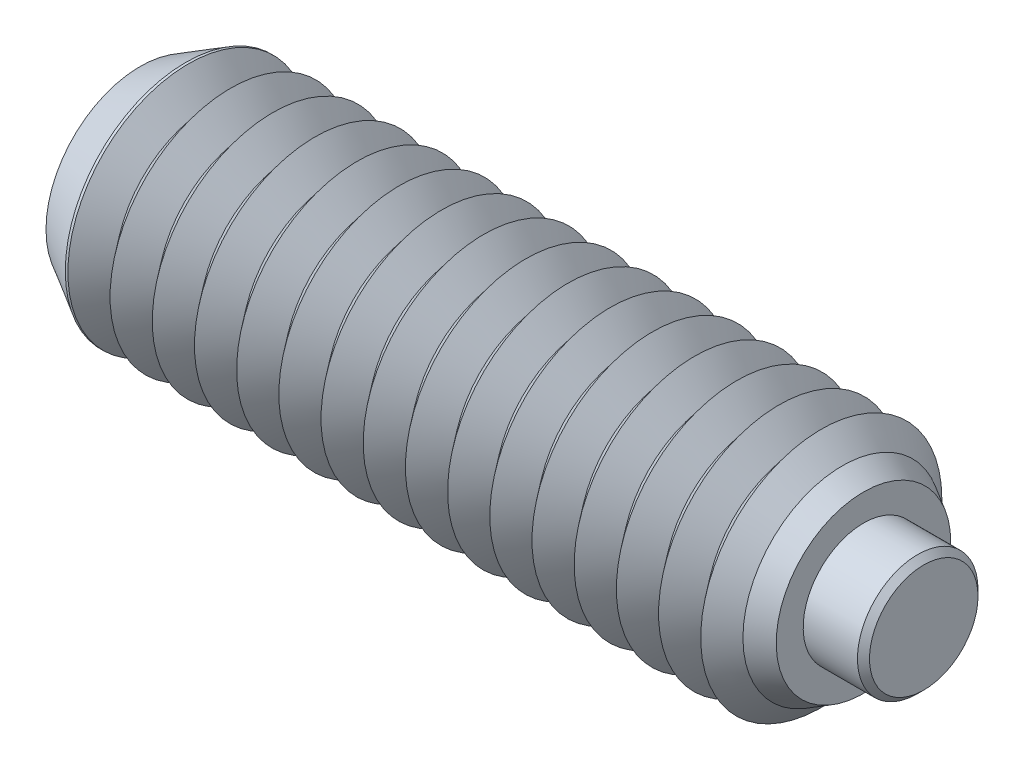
ISO-10303-21;
HEADER;
FILE_DESCRIPTION(('STEP AP214'),'2;1');
FILE_NAME('part.step','',(''),(''),'','','');
FILE_SCHEMA(('AUTOMOTIVE_DESIGN { 1 0 10303 214 1 1 1 1 }'));
ENDSEC;
DATA;
#1=APPLICATION_CONTEXT('core data for automotive mechanical design processes');
#2=APPLICATION_PROTOCOL_DEFINITION('international standard','automotive_design',2000,#1);
#3=PRODUCT_CONTEXT('',#1,'mechanical');
#4=PRODUCT('Part','Part','',(#3));
#5=PRODUCT_RELATED_PRODUCT_CATEGORY('part','',(#4));
#6=PRODUCT_DEFINITION_FORMATION('','',#4);
#7=PRODUCT_DEFINITION_CONTEXT('part definition',#1,'design');
#8=PRODUCT_DEFINITION('design','',#6,#7);
#9=PRODUCT_DEFINITION_SHAPE('','',#8);
#10=(LENGTH_UNIT() NAMED_UNIT(*) SI_UNIT(.MILLI.,.METRE.));
#11=(NAMED_UNIT(*) PLANE_ANGLE_UNIT() SI_UNIT($,.RADIAN.));
#12=(NAMED_UNIT(*) SI_UNIT($,.STERADIAN.) SOLID_ANGLE_UNIT());
#13=UNCERTAINTY_MEASURE_WITH_UNIT(LENGTH_MEASURE(1.E-05),#10,'distance_accuracy_value','');
#14=(GEOMETRIC_REPRESENTATION_CONTEXT(3) GLOBAL_UNCERTAINTY_ASSIGNED_CONTEXT((#13)) GLOBAL_UNIT_ASSIGNED_CONTEXT((#10,
#11,#12)) REPRESENTATION_CONTEXT('',''));
#15=CARTESIAN_POINT('',(0.,0.,0.));
#16=DIRECTION('',(0.,0.,1.));
#17=DIRECTION('',(1.,0.,0.));
#18=AXIS2_PLACEMENT_3D('',#15,#16,#17);
#19=CARTESIAN_POINT('',(1.35,0.,0.));
#20=DIRECTION('',(-1.,0.,0.));
#21=DIRECTION('',(0.,0.,1.));
#22=AXIS2_PLACEMENT_3D('',#19,#20,#21);
#23=CYLINDRICAL_SURFACE('',#22,1.);
#24=CARTESIAN_POINT('',(1.25,0.,0.));
#25=DIRECTION('',(1.,0.,0.));
#26=DIRECTION('',(0.,0.,-1.));
#27=AXIS2_PLACEMENT_3D('',#24,#25,#26);
#28=CIRCLE('',#27,1.);
#29=CARTESIAN_POINT('',(1.25,0.,-1.));
#30=VERTEX_POINT('',#29);
#31=EDGE_CURVE('P0_E10',#30,#30,#28,.F.);
#32=ORIENTED_EDGE('',*,*,#31,.T.);
#33=EDGE_LOOP('',(#32));
#34=FACE_BOUND('',#33,.T.);
#35=CARTESIAN_POINT('',(-0.65,0.,0.));
#36=DIRECTION('',(1.,0.,0.));
#37=DIRECTION('',(0.,0.,-1.));
#38=AXIS2_PLACEMENT_3D('',#35,#36,#37);
#39=CIRCLE('',#38,1.);
#40=CARTESIAN_POINT('',(-0.65,0.,-1.));
#41=VERTEX_POINT('',#40);
#42=EDGE_CURVE('P0_E25',#41,#41,#39,.T.);
#43=ORIENTED_EDGE('',*,*,#42,.T.);
#44=EDGE_LOOP('',(#43));
#45=FACE_BOUND('',#44,.T.);
#46=ADVANCED_FACE('P0_F14',(#34,#45),#23,.T.);
#47=CARTESIAN_POINT('',(1.35,0.,0.));
#48=DIRECTION('',(1.,0.,0.));
#49=DIRECTION('',(0.,0.,-1.));
#50=AXIS2_PLACEMENT_3D('',#47,#48,#49);
#51=PLANE('',#50);
#52=CARTESIAN_POINT('',(1.35,0.,0.));
#53=DIRECTION('',(1.,0.,0.));
#54=DIRECTION('',(0.,0.,-1.));
#55=AXIS2_PLACEMENT_3D('',#52,#53,#54);
#56=CIRCLE('',#55,0.899999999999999);
#57=CARTESIAN_POINT('',(1.35,0.,-0.899999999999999));
#58=VERTEX_POINT('',#57);
#59=EDGE_CURVE('P0_E21',#58,#58,#56,.T.);
#60=ORIENTED_EDGE('',*,*,#59,.T.);
#61=EDGE_LOOP('',(#60));
#62=FACE_BOUND('',#61,.T.);
#63=ADVANCED_FACE('P0_F35',(#62),#51,.T.);
#64=CARTESIAN_POINT('',(-0.65,0.,0.));
#65=DIRECTION('',(1.,0.,0.));
#66=DIRECTION('',(0.,0.,-1.));
#67=AXIS2_PLACEMENT_3D('',#64,#65,#66);
#68=PLANE('',#67);
#69=ORIENTED_EDGE('',*,*,#42,.F.);
#70=EDGE_LOOP('',(#69));
#71=FACE_BOUND('',#70,.T.);
#72=ADVANCED_FACE('P0_F33',(#71),#68,.F.);
#73=CARTESIAN_POINT('',(1.35,0.,0.));
#74=DIRECTION('',(-1.,0.,0.));
#75=DIRECTION('',(0.,0.,1.));
#76=AXIS2_PLACEMENT_3D('',#73,#74,#75);
#77=CONICAL_SURFACE('',#76,0.899999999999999,0.785398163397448);
#78=ORIENTED_EDGE('',*,*,#31,.F.);
#79=EDGE_LOOP('',(#78));
#80=FACE_BOUND('',#79,.T.);
#81=ORIENTED_EDGE('',*,*,#59,.F.);
#82=EDGE_LOOP('',(#81));
#83=FACE_BOUND('',#82,.T.);
#84=ADVANCED_FACE('P0_F16',(#80,#83),#77,.T.);
#85=CLOSED_SHELL('',(#46,#63,#72,#84));
#86=MANIFOLD_SOLID_BREP('P0_B1',#85);
#87=CARTESIAN_POINT('',(-11.65,0.,0.));
#88=DIRECTION('',(1.,0.,0.));
#89=DIRECTION('',(0.,0.,-1.));
#90=AXIS2_PLACEMENT_3D('',#87,#88,#89);
#91=CYLINDRICAL_SURFACE('',#90,2.);
#92=CARTESIAN_POINT('',(-10.85,0.,0.));
#93=DIRECTION('',(1.,0.,0.));
#94=DIRECTION('',(0.,0.,-1.));
#95=AXIS2_PLACEMENT_3D('',#92,#93,#94);
#96=CIRCLE('',#95,2.);
#97=CARTESIAN_POINT('',(-10.85,0.,-2.));
#98=VERTEX_POINT('',#97);
#99=EDGE_CURVE('P1_E226',#98,#98,#96,.T.);
#100=ORIENTED_EDGE('',*,*,#99,.F.);
#101=EDGE_LOOP('',(#100));
#102=FACE_BOUND('',#101,.T.);
#103=CARTESIAN_POINT('',(-10.8928342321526,0.,0.));
#104=DIRECTION('',(1.,0.,0.));
#105=DIRECTION('',(0.,0.,-1.));
#106=AXIS2_PLACEMENT_3D('',#103,#104,#105);
#107=CIRCLE('',#106,2.);
#108=CARTESIAN_POINT('',(-10.8928342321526,0.,-2.));
#109=VERTEX_POINT('',#108);
#110=EDGE_CURVE('P1_E229',#109,#109,#107,.T.);
#111=ORIENTED_EDGE('',*,*,#110,.T.);
#112=EDGE_LOOP('',(#111));
#113=FACE_BOUND('',#112,.T.);
#114=ADVANCED_FACE('P1_F15',(#102,#113),#91,.T.);
#115=CARTESIAN_POINT('',(-0.700000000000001,0.,0.));
#116=DIRECTION('',(1.,0.,0.));
#117=DIRECTION('',(0.,0.,-1.));
#118=AXIS2_PLACEMENT_3D('',#115,#116,#117);
#119=CONICAL_SURFACE('',#118,1.56285014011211,0.895664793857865);
#120=CARTESIAN_POINT('',(-0.350000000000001,0.,0.));
#121=DIRECTION('',(1.,0.,0.));
#122=DIRECTION('',(0.,0.,-1.));
#123=AXIS2_PLACEMENT_3D('',#120,#121,#122);
#124=CIRCLE('',#123,2.);
#125=CARTESIAN_POINT('',(-0.350000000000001,0.,-2.));
#126=VERTEX_POINT('',#125);
#127=EDGE_CURVE('P1_E284',#126,#126,#124,.T.);
#128=ORIENTED_EDGE('',*,*,#127,.F.);
#129=EDGE_LOOP('',(#128));
#130=FACE_BOUND('',#129,.T.);
#131=CARTESIAN_POINT('',(-0.700000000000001,0.,0.));
#132=DIRECTION('',(1.,0.,0.));
#133=DIRECTION('',(0.,0.,-1.));
#134=AXIS2_PLACEMENT_3D('',#131,#132,#133);
#135=CIRCLE('',#134,1.56285014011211);
#136=CARTESIAN_POINT('',(-0.700000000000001,0.,-1.56285014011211));
#137=VERTEX_POINT('',#136);
#138=EDGE_CURVE('P1_E289',#137,#137,#135,.T.);
#139=ORIENTED_EDGE('',*,*,#138,.T.);
#140=EDGE_LOOP('',(#139));
#141=FACE_BOUND('',#140,.T.);
#142=ADVANCED_FACE('P1_F214',(#130,#141),#119,.T.);
#143=CARTESIAN_POINT('',(-1.05,0.,0.));
#144=DIRECTION('',(-1.,0.,0.));
#145=DIRECTION('',(0.,0.,1.));
#146=AXIS2_PLACEMENT_3D('',#143,#144,#145);
#147=CONICAL_SURFACE('',#146,2.,0.895664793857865);
#148=ORIENTED_EDGE('',*,*,#138,.F.);
#149=EDGE_LOOP('',(#148));
#150=FACE_BOUND('',#149,.T.);
#151=CARTESIAN_POINT('',(-1.05,0.,0.));
#152=DIRECTION('',(1.,0.,0.));
#153=DIRECTION('',(0.,0.,-1.));
#154=AXIS2_PLACEMENT_3D('',#151,#152,#153);
#155=CIRCLE('',#154,2.);
#156=CARTESIAN_POINT('',(-1.05,0.,-2.));
#157=VERTEX_POINT('',#156);
#158=EDGE_CURVE('P1_E292',#157,#157,#155,.T.);
#159=ORIENTED_EDGE('',*,*,#158,.T.);
#160=EDGE_LOOP('',(#159));
#161=FACE_BOUND('',#160,.T.);
#162=ADVANCED_FACE('P1_F220',(#150,#161),#147,.T.);
#163=CARTESIAN_POINT('',(-0.65,0.,0.));
#164=DIRECTION('',(1.,0.,0.));
#165=DIRECTION('',(0.,1.,0.));
#166=AXIS2_PLACEMENT_3D('',#163,#164,#165);
#167=PLANE('',#166);
#168=CARTESIAN_POINT('',(-0.65,0.,0.));
#169=DIRECTION('',(1.,0.,0.));
#170=DIRECTION('',(0.,1.,0.));
#171=AXIS2_PLACEMENT_3D('',#168,#169,#170);
#172=CIRCLE('',#171,1.);
#173=CARTESIAN_POINT('',(-0.65,1.,0.));
#174=VERTEX_POINT('',#173);
#175=EDGE_CURVE('P1_E279',#174,#174,#172,.T.);
#176=ORIENTED_EDGE('',*,*,#175,.T.);
#177=EDGE_LOOP('',(#176));
#178=FACE_BOUND('',#177,.T.);
#179=ADVANCED_FACE('P1_F493',(#178),#167,.T.);
#180=CARTESIAN_POINT('',(-0.65,0.,0.));
#181=DIRECTION('',(1.,0.,0.));
#182=DIRECTION('',(0.,1.,0.));
#183=AXIS2_PLACEMENT_3D('',#180,#181,#182);
#184=CYLINDRICAL_SURFACE('',#183,1.);
#185=ORIENTED_EDGE('',*,*,#175,.F.);
#186=EDGE_LOOP('',(#185));
#187=FACE_BOUND('',#186,.T.);
#188=CARTESIAN_POINT('',(0.35,0.,0.));
#189=DIRECTION('',(1.,0.,0.));
#190=DIRECTION('',(0.,1.,0.));
#191=AXIS2_PLACEMENT_3D('',#188,#189,#190);
#192=CIRCLE('',#191,1.);
#193=CARTESIAN_POINT('',(0.35,1.,0.));
#194=VERTEX_POINT('',#193);
#195=EDGE_CURVE('P1_E281',#194,#194,#192,.T.);
#196=ORIENTED_EDGE('',*,*,#195,.T.);
#197=EDGE_LOOP('',(#196));
#198=FACE_BOUND('',#197,.T.);
#199=ADVANCED_FACE('P1_F210',(#187,#198),#184,.F.);
#200=CARTESIAN_POINT('',(0.35,1.44792740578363,0.));
#201=DIRECTION('',(1.,0.,0.));
#202=DIRECTION('',(0.,1.,0.));
#203=AXIS2_PLACEMENT_3D('',#200,#201,#202);
#204=PLANE('',#203);
#205=ORIENTED_EDGE('',*,*,#195,.F.);
#206=EDGE_LOOP('',(#205));
#207=FACE_BOUND('',#206,.T.);
#208=CARTESIAN_POINT('',(0.35,0.,0.));
#209=DIRECTION('',(1.,0.,0.));
#210=DIRECTION('',(0.,1.,0.));
#211=AXIS2_PLACEMENT_3D('',#208,#209,#210);
#212=CIRCLE('',#211,1.44792740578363);
#213=CARTESIAN_POINT('',(0.35,1.44792740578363,0.));
#214=VERTEX_POINT('',#213);
#215=EDGE_CURVE('P1_E121',#214,#214,#212,.T.);
#216=ORIENTED_EDGE('',*,*,#215,.T.);
#217=EDGE_LOOP('',(#216));
#218=FACE_BOUND('',#217,.T.);
#219=ADVANCED_FACE('P1_F206',(#207,#218),#204,.T.);
#220=CARTESIAN_POINT('',(0.35,0.,0.));
#221=DIRECTION('',(-1.,0.,0.));
#222=DIRECTION('',(0.,-1.,0.));
#223=AXIS2_PLACEMENT_3D('',#220,#221,#222);
#224=CONICAL_SURFACE('',#223,1.44792740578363,0.523598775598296);
#225=CARTESIAN_POINT('',(0.,0.,0.));
#226=DIRECTION('',(1.,0.,0.));
#227=DIRECTION('',(0.,0.,-1.));
#228=AXIS2_PLACEMENT_3D('',#225,#226,#227);
#229=CIRCLE('',#228,1.65);
#230=CARTESIAN_POINT('',(0.,0.,-1.65));
#231=VERTEX_POINT('',#230);
#232=EDGE_CURVE('P1_E236',#231,#231,#229,.T.);
#233=ORIENTED_EDGE('',*,*,#232,.T.);
#234=EDGE_LOOP('',(#233));
#235=FACE_BOUND('',#234,.T.);
#236=ORIENTED_EDGE('',*,*,#215,.F.);
#237=EDGE_LOOP('',(#236));
#238=FACE_BOUND('',#237,.T.);
#239=ADVANCED_FACE('P1_F203',(#235,#238),#224,.T.);
#240=CARTESIAN_POINT('',(0.,0.,0.));
#241=DIRECTION('',(-1.,0.,0.));
#242=DIRECTION('',(0.,0.,1.));
#243=AXIS2_PLACEMENT_3D('',#240,#241,#242);
#244=CONICAL_SURFACE('',#243,1.65,0.785398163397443);
#245=ORIENTED_EDGE('',*,*,#127,.T.);
#246=EDGE_LOOP('',(#245));
#247=FACE_BOUND('',#246,.T.);
#248=ORIENTED_EDGE('',*,*,#232,.F.);
#249=EDGE_LOOP('',(#248));
#250=FACE_BOUND('',#249,.T.);
#251=ADVANCED_FACE('P1_F17',(#247,#250),#244,.T.);
#252=CARTESIAN_POINT('',(-1.4,0.,0.));
#253=DIRECTION('',(1.,0.,0.));
#254=DIRECTION('',(0.,0.,-1.));
#255=AXIS2_PLACEMENT_3D('',#252,#253,#254);
#256=CONICAL_SURFACE('',#255,1.56285014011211,0.895664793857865);
#257=ORIENTED_EDGE('',*,*,#158,.F.);
#258=EDGE_LOOP('',(#257));
#259=FACE_BOUND('',#258,.T.);
#260=CARTESIAN_POINT('',(-1.4,0.,0.));
#261=DIRECTION('',(1.,0.,0.));
#262=DIRECTION('',(0.,0.,-1.));
#263=AXIS2_PLACEMENT_3D('',#260,#261,#262);
#264=CIRCLE('',#263,1.56285014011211);
#265=CARTESIAN_POINT('',(-1.4,0.,-1.56285014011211));
#266=VERTEX_POINT('',#265);
#267=EDGE_CURVE('P1_E295',#266,#266,#264,.T.);
#268=ORIENTED_EDGE('',*,*,#267,.T.);
#269=EDGE_LOOP('',(#268));
#270=FACE_BOUND('',#269,.T.);
#271=ADVANCED_FACE('P1_F487',(#259,#270),#256,.T.);
#272=CARTESIAN_POINT('',(-1.75,0.,0.));
#273=DIRECTION('',(-1.,0.,0.));
#274=DIRECTION('',(0.,0.,1.));
#275=AXIS2_PLACEMENT_3D('',#272,#273,#274);
#276=CONICAL_SURFACE('',#275,2.,0.895664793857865);
#277=ORIENTED_EDGE('',*,*,#267,.F.);
#278=EDGE_LOOP('',(#277));
#279=FACE_BOUND('',#278,.T.);
#280=CARTESIAN_POINT('',(-1.75,0.,0.));
#281=DIRECTION('',(1.,0.,0.));
#282=DIRECTION('',(0.,0.,-1.));
#283=AXIS2_PLACEMENT_3D('',#280,#281,#282);
#284=CIRCLE('',#283,2.);
#285=CARTESIAN_POINT('',(-1.75,0.,-2.));
#286=VERTEX_POINT('',#285);
#287=EDGE_CURVE('P1_E298',#286,#286,#284,.T.);
#288=ORIENTED_EDGE('',*,*,#287,.T.);
#289=EDGE_LOOP('',(#288));
#290=FACE_BOUND('',#289,.T.);
#291=ADVANCED_FACE('P1_F483',(#279,#290),#276,.T.);
#292=CARTESIAN_POINT('',(-2.1,0.,0.));
#293=DIRECTION('',(1.,0.,0.));
#294=DIRECTION('',(0.,0.,-1.));
#295=AXIS2_PLACEMENT_3D('',#292,#293,#294);
#296=CONICAL_SURFACE('',#295,1.56285014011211,0.895664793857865);
#297=ORIENTED_EDGE('',*,*,#287,.F.);
#298=EDGE_LOOP('',(#297));
#299=FACE_BOUND('',#298,.T.);
#300=CARTESIAN_POINT('',(-2.1,0.,0.));
#301=DIRECTION('',(1.,0.,0.));
#302=DIRECTION('',(0.,0.,-1.));
#303=AXIS2_PLACEMENT_3D('',#300,#301,#302);
#304=CIRCLE('',#303,1.56285014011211);
#305=CARTESIAN_POINT('',(-2.1,0.,-1.56285014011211));
#306=VERTEX_POINT('',#305);
#307=EDGE_CURVE('P1_E301',#306,#306,#304,.T.);
#308=ORIENTED_EDGE('',*,*,#307,.T.);
#309=EDGE_LOOP('',(#308));
#310=FACE_BOUND('',#309,.T.);
#311=ADVANCED_FACE('P1_F479',(#299,#310),#296,.T.);
#312=CARTESIAN_POINT('',(-2.45,0.,0.));
#313=DIRECTION('',(-1.,0.,0.));
#314=DIRECTION('',(0.,0.,1.));
#315=AXIS2_PLACEMENT_3D('',#312,#313,#314);
#316=CONICAL_SURFACE('',#315,2.,0.895664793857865);
#317=ORIENTED_EDGE('',*,*,#307,.F.);
#318=EDGE_LOOP('',(#317));
#319=FACE_BOUND('',#318,.T.);
#320=CARTESIAN_POINT('',(-2.45,0.,0.));
#321=DIRECTION('',(1.,0.,0.));
#322=DIRECTION('',(0.,0.,-1.));
#323=AXIS2_PLACEMENT_3D('',#320,#321,#322);
#324=CIRCLE('',#323,2.);
#325=CARTESIAN_POINT('',(-2.45,0.,-2.));
#326=VERTEX_POINT('',#325);
#327=EDGE_CURVE('P1_E304',#326,#326,#324,.T.);
#328=ORIENTED_EDGE('',*,*,#327,.T.);
#329=EDGE_LOOP('',(#328));
#330=FACE_BOUND('',#329,.T.);
#331=ADVANCED_FACE('P1_F475',(#319,#330),#316,.T.);
#332=CARTESIAN_POINT('',(-2.8,0.,0.));
#333=DIRECTION('',(1.,0.,0.));
#334=DIRECTION('',(0.,0.,-1.));
#335=AXIS2_PLACEMENT_3D('',#332,#333,#334);
#336=CONICAL_SURFACE('',#335,1.56285014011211,0.895664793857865);
#337=ORIENTED_EDGE('',*,*,#327,.F.);
#338=EDGE_LOOP('',(#337));
#339=FACE_BOUND('',#338,.T.);
#340=CARTESIAN_POINT('',(-2.8,0.,0.));
#341=DIRECTION('',(1.,0.,0.));
#342=DIRECTION('',(0.,0.,-1.));
#343=AXIS2_PLACEMENT_3D('',#340,#341,#342);
#344=CIRCLE('',#343,1.56285014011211);
#345=CARTESIAN_POINT('',(-2.8,0.,-1.56285014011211));
#346=VERTEX_POINT('',#345);
#347=EDGE_CURVE('P1_E307',#346,#346,#344,.T.);
#348=ORIENTED_EDGE('',*,*,#347,.T.);
#349=EDGE_LOOP('',(#348));
#350=FACE_BOUND('',#349,.T.);
#351=ADVANCED_FACE('P1_F471',(#339,#350),#336,.T.);
#352=CARTESIAN_POINT('',(-3.15,0.,0.));
#353=DIRECTION('',(-1.,0.,0.));
#354=DIRECTION('',(0.,0.,1.));
#355=AXIS2_PLACEMENT_3D('',#352,#353,#354);
#356=CONICAL_SURFACE('',#355,2.,0.895664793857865);
#357=ORIENTED_EDGE('',*,*,#347,.F.);
#358=EDGE_LOOP('',(#357));
#359=FACE_BOUND('',#358,.T.);
#360=CARTESIAN_POINT('',(-3.15,0.,0.));
#361=DIRECTION('',(1.,0.,0.));
#362=DIRECTION('',(0.,0.,-1.));
#363=AXIS2_PLACEMENT_3D('',#360,#361,#362);
#364=CIRCLE('',#363,2.);
#365=CARTESIAN_POINT('',(-3.15,0.,-2.));
#366=VERTEX_POINT('',#365);
#367=EDGE_CURVE('P1_E310',#366,#366,#364,.T.);
#368=ORIENTED_EDGE('',*,*,#367,.T.);
#369=EDGE_LOOP('',(#368));
#370=FACE_BOUND('',#369,.T.);
#371=ADVANCED_FACE('P1_F467',(#359,#370),#356,.T.);
#372=CARTESIAN_POINT('',(-3.5,0.,0.));
#373=DIRECTION('',(1.,0.,0.));
#374=DIRECTION('',(0.,0.,-1.));
#375=AXIS2_PLACEMENT_3D('',#372,#373,#374);
#376=CONICAL_SURFACE('',#375,1.56285014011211,0.895664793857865);
#377=ORIENTED_EDGE('',*,*,#367,.F.);
#378=EDGE_LOOP('',(#377));
#379=FACE_BOUND('',#378,.T.);
#380=CARTESIAN_POINT('',(-3.5,0.,0.));
#381=DIRECTION('',(1.,0.,0.));
#382=DIRECTION('',(0.,0.,-1.));
#383=AXIS2_PLACEMENT_3D('',#380,#381,#382);
#384=CIRCLE('',#383,1.56285014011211);
#385=CARTESIAN_POINT('',(-3.5,0.,-1.56285014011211));
#386=VERTEX_POINT('',#385);
#387=EDGE_CURVE('P1_E313',#386,#386,#384,.T.);
#388=ORIENTED_EDGE('',*,*,#387,.T.);
#389=EDGE_LOOP('',(#388));
#390=FACE_BOUND('',#389,.T.);
#391=ADVANCED_FACE('P1_F463',(#379,#390),#376,.T.);
#392=CARTESIAN_POINT('',(-3.85,0.,0.));
#393=DIRECTION('',(-1.,0.,0.));
#394=DIRECTION('',(0.,0.,1.));
#395=AXIS2_PLACEMENT_3D('',#392,#393,#394);
#396=CONICAL_SURFACE('',#395,2.,0.895664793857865);
#397=ORIENTED_EDGE('',*,*,#387,.F.);
#398=EDGE_LOOP('',(#397));
#399=FACE_BOUND('',#398,.T.);
#400=CARTESIAN_POINT('',(-3.85,0.,0.));
#401=DIRECTION('',(1.,0.,0.));
#402=DIRECTION('',(0.,0.,-1.));
#403=AXIS2_PLACEMENT_3D('',#400,#401,#402);
#404=CIRCLE('',#403,2.);
#405=CARTESIAN_POINT('',(-3.85,0.,-2.));
#406=VERTEX_POINT('',#405);
#407=EDGE_CURVE('P1_E316',#406,#406,#404,.T.);
#408=ORIENTED_EDGE('',*,*,#407,.T.);
#409=EDGE_LOOP('',(#408));
#410=FACE_BOUND('',#409,.T.);
#411=ADVANCED_FACE('P1_F459',(#399,#410),#396,.T.);
#412=CARTESIAN_POINT('',(-4.2,0.,0.));
#413=DIRECTION('',(1.,0.,0.));
#414=DIRECTION('',(0.,0.,-1.));
#415=AXIS2_PLACEMENT_3D('',#412,#413,#414);
#416=CONICAL_SURFACE('',#415,1.56285014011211,0.895664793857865);
#417=ORIENTED_EDGE('',*,*,#407,.F.);
#418=EDGE_LOOP('',(#417));
#419=FACE_BOUND('',#418,.T.);
#420=CARTESIAN_POINT('',(-4.2,0.,0.));
#421=DIRECTION('',(1.,0.,0.));
#422=DIRECTION('',(0.,0.,-1.));
#423=AXIS2_PLACEMENT_3D('',#420,#421,#422);
#424=CIRCLE('',#423,1.56285014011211);
#425=CARTESIAN_POINT('',(-4.2,0.,-1.56285014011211));
#426=VERTEX_POINT('',#425);
#427=EDGE_CURVE('P1_E319',#426,#426,#424,.T.);
#428=ORIENTED_EDGE('',*,*,#427,.T.);
#429=EDGE_LOOP('',(#428));
#430=FACE_BOUND('',#429,.T.);
#431=ADVANCED_FACE('P1_F455',(#419,#430),#416,.T.);
#432=CARTESIAN_POINT('',(-4.55,0.,0.));
#433=DIRECTION('',(-1.,0.,0.));
#434=DIRECTION('',(0.,0.,1.));
#435=AXIS2_PLACEMENT_3D('',#432,#433,#434);
#436=CONICAL_SURFACE('',#435,2.,0.895664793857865);
#437=ORIENTED_EDGE('',*,*,#427,.F.);
#438=EDGE_LOOP('',(#437));
#439=FACE_BOUND('',#438,.T.);
#440=CARTESIAN_POINT('',(-4.55,0.,0.));
#441=DIRECTION('',(1.,0.,0.));
#442=DIRECTION('',(0.,0.,-1.));
#443=AXIS2_PLACEMENT_3D('',#440,#441,#442);
#444=CIRCLE('',#443,2.);
#445=CARTESIAN_POINT('',(-4.55,0.,-2.));
#446=VERTEX_POINT('',#445);
#447=EDGE_CURVE('P1_E322',#446,#446,#444,.T.);
#448=ORIENTED_EDGE('',*,*,#447,.T.);
#449=EDGE_LOOP('',(#448));
#450=FACE_BOUND('',#449,.T.);
#451=ADVANCED_FACE('P1_F451',(#439,#450),#436,.T.);
#452=CARTESIAN_POINT('',(-4.9,0.,0.));
#453=DIRECTION('',(1.,0.,0.));
#454=DIRECTION('',(0.,0.,-1.));
#455=AXIS2_PLACEMENT_3D('',#452,#453,#454);
#456=CONICAL_SURFACE('',#455,1.56285014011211,0.895664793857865);
#457=ORIENTED_EDGE('',*,*,#447,.F.);
#458=EDGE_LOOP('',(#457));
#459=FACE_BOUND('',#458,.T.);
#460=CARTESIAN_POINT('',(-4.9,0.,0.));
#461=DIRECTION('',(1.,0.,0.));
#462=DIRECTION('',(0.,0.,-1.));
#463=AXIS2_PLACEMENT_3D('',#460,#461,#462);
#464=CIRCLE('',#463,1.56285014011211);
#465=CARTESIAN_POINT('',(-4.9,0.,-1.56285014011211));
#466=VERTEX_POINT('',#465);
#467=EDGE_CURVE('P1_E325',#466,#466,#464,.T.);
#468=ORIENTED_EDGE('',*,*,#467,.T.);
#469=EDGE_LOOP('',(#468));
#470=FACE_BOUND('',#469,.T.);
#471=ADVANCED_FACE('P1_F447',(#459,#470),#456,.T.);
#472=CARTESIAN_POINT('',(-5.25,0.,0.));
#473=DIRECTION('',(-1.,0.,0.));
#474=DIRECTION('',(0.,0.,1.));
#475=AXIS2_PLACEMENT_3D('',#472,#473,#474);
#476=CONICAL_SURFACE('',#475,2.,0.895664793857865);
#477=ORIENTED_EDGE('',*,*,#467,.F.);
#478=EDGE_LOOP('',(#477));
#479=FACE_BOUND('',#478,.T.);
#480=CARTESIAN_POINT('',(-5.25,0.,0.));
#481=DIRECTION('',(1.,0.,0.));
#482=DIRECTION('',(0.,0.,-1.));
#483=AXIS2_PLACEMENT_3D('',#480,#481,#482);
#484=CIRCLE('',#483,2.);
#485=CARTESIAN_POINT('',(-5.25,0.,-2.));
#486=VERTEX_POINT('',#485);
#487=EDGE_CURVE('P1_E328',#486,#486,#484,.T.);
#488=ORIENTED_EDGE('',*,*,#487,.T.);
#489=EDGE_LOOP('',(#488));
#490=FACE_BOUND('',#489,.T.);
#491=ADVANCED_FACE('P1_F443',(#479,#490),#476,.T.);
#492=CARTESIAN_POINT('',(-5.6,0.,0.));
#493=DIRECTION('',(1.,0.,0.));
#494=DIRECTION('',(0.,0.,-1.));
#495=AXIS2_PLACEMENT_3D('',#492,#493,#494);
#496=CONICAL_SURFACE('',#495,1.56285014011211,0.895664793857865);
#497=ORIENTED_EDGE('',*,*,#487,.F.);
#498=EDGE_LOOP('',(#497));
#499=FACE_BOUND('',#498,.T.);
#500=CARTESIAN_POINT('',(-5.6,0.,0.));
#501=DIRECTION('',(1.,0.,0.));
#502=DIRECTION('',(0.,0.,-1.));
#503=AXIS2_PLACEMENT_3D('',#500,#501,#502);
#504=CIRCLE('',#503,1.56285014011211);
#505=CARTESIAN_POINT('',(-5.6,0.,-1.56285014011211));
#506=VERTEX_POINT('',#505);
#507=EDGE_CURVE('P1_E331',#506,#506,#504,.T.);
#508=ORIENTED_EDGE('',*,*,#507,.T.);
#509=EDGE_LOOP('',(#508));
#510=FACE_BOUND('',#509,.T.);
#511=ADVANCED_FACE('P1_F439',(#499,#510),#496,.T.);
#512=CARTESIAN_POINT('',(-5.95,0.,0.));
#513=DIRECTION('',(-1.,0.,0.));
#514=DIRECTION('',(0.,0.,1.));
#515=AXIS2_PLACEMENT_3D('',#512,#513,#514);
#516=CONICAL_SURFACE('',#515,2.,0.895664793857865);
#517=ORIENTED_EDGE('',*,*,#507,.F.);
#518=EDGE_LOOP('',(#517));
#519=FACE_BOUND('',#518,.T.);
#520=CARTESIAN_POINT('',(-5.95,0.,0.));
#521=DIRECTION('',(1.,0.,0.));
#522=DIRECTION('',(0.,0.,-1.));
#523=AXIS2_PLACEMENT_3D('',#520,#521,#522);
#524=CIRCLE('',#523,2.);
#525=CARTESIAN_POINT('',(-5.95,0.,-2.));
#526=VERTEX_POINT('',#525);
#527=EDGE_CURVE('P1_E334',#526,#526,#524,.T.);
#528=ORIENTED_EDGE('',*,*,#527,.T.);
#529=EDGE_LOOP('',(#528));
#530=FACE_BOUND('',#529,.T.);
#531=ADVANCED_FACE('P1_F435',(#519,#530),#516,.T.);
#532=CARTESIAN_POINT('',(-6.3,0.,0.));
#533=DIRECTION('',(1.,0.,0.));
#534=DIRECTION('',(0.,0.,-1.));
#535=AXIS2_PLACEMENT_3D('',#532,#533,#534);
#536=CONICAL_SURFACE('',#535,1.56285014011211,0.895664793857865);
#537=ORIENTED_EDGE('',*,*,#527,.F.);
#538=EDGE_LOOP('',(#537));
#539=FACE_BOUND('',#538,.T.);
#540=CARTESIAN_POINT('',(-6.3,0.,0.));
#541=DIRECTION('',(1.,0.,0.));
#542=DIRECTION('',(0.,0.,-1.));
#543=AXIS2_PLACEMENT_3D('',#540,#541,#542);
#544=CIRCLE('',#543,1.56285014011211);
#545=CARTESIAN_POINT('',(-6.3,0.,-1.56285014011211));
#546=VERTEX_POINT('',#545);
#547=EDGE_CURVE('P1_E337',#546,#546,#544,.T.);
#548=ORIENTED_EDGE('',*,*,#547,.T.);
#549=EDGE_LOOP('',(#548));
#550=FACE_BOUND('',#549,.T.);
#551=ADVANCED_FACE('P1_F431',(#539,#550),#536,.T.);
#552=CARTESIAN_POINT('',(-6.65,0.,0.));
#553=DIRECTION('',(-1.,0.,0.));
#554=DIRECTION('',(0.,0.,1.));
#555=AXIS2_PLACEMENT_3D('',#552,#553,#554);
#556=CONICAL_SURFACE('',#555,2.,0.895664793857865);
#557=ORIENTED_EDGE('',*,*,#547,.F.);
#558=EDGE_LOOP('',(#557));
#559=FACE_BOUND('',#558,.T.);
#560=CARTESIAN_POINT('',(-6.65,0.,0.));
#561=DIRECTION('',(1.,0.,0.));
#562=DIRECTION('',(0.,0.,-1.));
#563=AXIS2_PLACEMENT_3D('',#560,#561,#562);
#564=CIRCLE('',#563,2.);
#565=CARTESIAN_POINT('',(-6.65,0.,-2.));
#566=VERTEX_POINT('',#565);
#567=EDGE_CURVE('P1_E340',#566,#566,#564,.T.);
#568=ORIENTED_EDGE('',*,*,#567,.T.);
#569=EDGE_LOOP('',(#568));
#570=FACE_BOUND('',#569,.T.);
#571=ADVANCED_FACE('P1_F427',(#559,#570),#556,.T.);
#572=CARTESIAN_POINT('',(-7.,0.,0.));
#573=DIRECTION('',(1.,0.,0.));
#574=DIRECTION('',(0.,0.,-1.));
#575=AXIS2_PLACEMENT_3D('',#572,#573,#574);
#576=CONICAL_SURFACE('',#575,1.56285014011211,0.895664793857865);
#577=ORIENTED_EDGE('',*,*,#567,.F.);
#578=EDGE_LOOP('',(#577));
#579=FACE_BOUND('',#578,.T.);
#580=CARTESIAN_POINT('',(-7.,0.,0.));
#581=DIRECTION('',(1.,0.,0.));
#582=DIRECTION('',(0.,0.,-1.));
#583=AXIS2_PLACEMENT_3D('',#580,#581,#582);
#584=CIRCLE('',#583,1.56285014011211);
#585=CARTESIAN_POINT('',(-7.,0.,-1.56285014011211));
#586=VERTEX_POINT('',#585);
#587=EDGE_CURVE('P1_E343',#586,#586,#584,.T.);
#588=ORIENTED_EDGE('',*,*,#587,.T.);
#589=EDGE_LOOP('',(#588));
#590=FACE_BOUND('',#589,.T.);
#591=ADVANCED_FACE('P1_F423',(#579,#590),#576,.T.);
#592=CARTESIAN_POINT('',(-7.35,0.,0.));
#593=DIRECTION('',(-1.,0.,0.));
#594=DIRECTION('',(0.,0.,1.));
#595=AXIS2_PLACEMENT_3D('',#592,#593,#594);
#596=CONICAL_SURFACE('',#595,2.,0.895664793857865);
#597=ORIENTED_EDGE('',*,*,#587,.F.);
#598=EDGE_LOOP('',(#597));
#599=FACE_BOUND('',#598,.T.);
#600=CARTESIAN_POINT('',(-7.35,0.,0.));
#601=DIRECTION('',(1.,0.,0.));
#602=DIRECTION('',(0.,0.,-1.));
#603=AXIS2_PLACEMENT_3D('',#600,#601,#602);
#604=CIRCLE('',#603,2.);
#605=CARTESIAN_POINT('',(-7.35,0.,-2.));
#606=VERTEX_POINT('',#605);
#607=EDGE_CURVE('P1_E346',#606,#606,#604,.T.);
#608=ORIENTED_EDGE('',*,*,#607,.T.);
#609=EDGE_LOOP('',(#608));
#610=FACE_BOUND('',#609,.T.);
#611=ADVANCED_FACE('P1_F419',(#599,#610),#596,.T.);
#612=CARTESIAN_POINT('',(-7.7,0.,0.));
#613=DIRECTION('',(1.,0.,0.));
#614=DIRECTION('',(0.,0.,-1.));
#615=AXIS2_PLACEMENT_3D('',#612,#613,#614);
#616=CONICAL_SURFACE('',#615,1.56285014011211,0.895664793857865);
#617=ORIENTED_EDGE('',*,*,#607,.F.);
#618=EDGE_LOOP('',(#617));
#619=FACE_BOUND('',#618,.T.);
#620=CARTESIAN_POINT('',(-7.7,0.,0.));
#621=DIRECTION('',(1.,0.,0.));
#622=DIRECTION('',(0.,0.,-1.));
#623=AXIS2_PLACEMENT_3D('',#620,#621,#622);
#624=CIRCLE('',#623,1.56285014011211);
#625=CARTESIAN_POINT('',(-7.7,0.,-1.56285014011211));
#626=VERTEX_POINT('',#625);
#627=EDGE_CURVE('P1_E349',#626,#626,#624,.T.);
#628=ORIENTED_EDGE('',*,*,#627,.T.);
#629=EDGE_LOOP('',(#628));
#630=FACE_BOUND('',#629,.T.);
#631=ADVANCED_FACE('P1_F415',(#619,#630),#616,.T.);
#632=CARTESIAN_POINT('',(-8.05,0.,0.));
#633=DIRECTION('',(-1.,0.,0.));
#634=DIRECTION('',(0.,0.,1.));
#635=AXIS2_PLACEMENT_3D('',#632,#633,#634);
#636=CONICAL_SURFACE('',#635,2.,0.895664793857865);
#637=ORIENTED_EDGE('',*,*,#627,.F.);
#638=EDGE_LOOP('',(#637));
#639=FACE_BOUND('',#638,.T.);
#640=CARTESIAN_POINT('',(-8.05,0.,0.));
#641=DIRECTION('',(1.,0.,0.));
#642=DIRECTION('',(0.,0.,-1.));
#643=AXIS2_PLACEMENT_3D('',#640,#641,#642);
#644=CIRCLE('',#643,2.);
#645=CARTESIAN_POINT('',(-8.05,0.,-2.));
#646=VERTEX_POINT('',#645);
#647=EDGE_CURVE('P1_E352',#646,#646,#644,.T.);
#648=ORIENTED_EDGE('',*,*,#647,.T.);
#649=EDGE_LOOP('',(#648));
#650=FACE_BOUND('',#649,.T.);
#651=ADVANCED_FACE('P1_F411',(#639,#650),#636,.T.);
#652=CARTESIAN_POINT('',(-8.4,0.,0.));
#653=DIRECTION('',(1.,0.,0.));
#654=DIRECTION('',(0.,0.,-1.));
#655=AXIS2_PLACEMENT_3D('',#652,#653,#654);
#656=CONICAL_SURFACE('',#655,1.56285014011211,0.895664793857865);
#657=ORIENTED_EDGE('',*,*,#647,.F.);
#658=EDGE_LOOP('',(#657));
#659=FACE_BOUND('',#658,.T.);
#660=CARTESIAN_POINT('',(-8.4,0.,0.));
#661=DIRECTION('',(1.,0.,0.));
#662=DIRECTION('',(0.,0.,-1.));
#663=AXIS2_PLACEMENT_3D('',#660,#661,#662);
#664=CIRCLE('',#663,1.56285014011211);
#665=CARTESIAN_POINT('',(-8.4,0.,-1.56285014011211));
#666=VERTEX_POINT('',#665);
#667=EDGE_CURVE('P1_E355',#666,#666,#664,.T.);
#668=ORIENTED_EDGE('',*,*,#667,.T.);
#669=EDGE_LOOP('',(#668));
#670=FACE_BOUND('',#669,.T.);
#671=ADVANCED_FACE('P1_F407',(#659,#670),#656,.T.);
#672=CARTESIAN_POINT('',(-8.75,0.,0.));
#673=DIRECTION('',(-1.,0.,0.));
#674=DIRECTION('',(0.,0.,1.));
#675=AXIS2_PLACEMENT_3D('',#672,#673,#674);
#676=CONICAL_SURFACE('',#675,2.,0.895664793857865);
#677=ORIENTED_EDGE('',*,*,#667,.F.);
#678=EDGE_LOOP('',(#677));
#679=FACE_BOUND('',#678,.T.);
#680=CARTESIAN_POINT('',(-8.75,0.,0.));
#681=DIRECTION('',(1.,0.,0.));
#682=DIRECTION('',(0.,0.,-1.));
#683=AXIS2_PLACEMENT_3D('',#680,#681,#682);
#684=CIRCLE('',#683,2.);
#685=CARTESIAN_POINT('',(-8.75,0.,-2.));
#686=VERTEX_POINT('',#685);
#687=EDGE_CURVE('P1_E358',#686,#686,#684,.T.);
#688=ORIENTED_EDGE('',*,*,#687,.T.);
#689=EDGE_LOOP('',(#688));
#690=FACE_BOUND('',#689,.T.);
#691=ADVANCED_FACE('P1_F403',(#679,#690),#676,.T.);
#692=CARTESIAN_POINT('',(-9.1,0.,0.));
#693=DIRECTION('',(1.,0.,0.));
#694=DIRECTION('',(0.,0.,-1.));
#695=AXIS2_PLACEMENT_3D('',#692,#693,#694);
#696=CONICAL_SURFACE('',#695,1.56285014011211,0.895664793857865);
#697=ORIENTED_EDGE('',*,*,#687,.F.);
#698=EDGE_LOOP('',(#697));
#699=FACE_BOUND('',#698,.T.);
#700=CARTESIAN_POINT('',(-9.1,0.,0.));
#701=DIRECTION('',(1.,0.,0.));
#702=DIRECTION('',(0.,0.,-1.));
#703=AXIS2_PLACEMENT_3D('',#700,#701,#702);
#704=CIRCLE('',#703,1.56285014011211);
#705=CARTESIAN_POINT('',(-9.1,0.,-1.56285014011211));
#706=VERTEX_POINT('',#705);
#707=EDGE_CURVE('P1_E361',#706,#706,#704,.T.);
#708=ORIENTED_EDGE('',*,*,#707,.T.);
#709=EDGE_LOOP('',(#708));
#710=FACE_BOUND('',#709,.T.);
#711=ADVANCED_FACE('P1_F399',(#699,#710),#696,.T.);
#712=CARTESIAN_POINT('',(-9.45,0.,0.));
#713=DIRECTION('',(-1.,0.,0.));
#714=DIRECTION('',(0.,0.,1.));
#715=AXIS2_PLACEMENT_3D('',#712,#713,#714);
#716=CONICAL_SURFACE('',#715,2.,0.895664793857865);
#717=ORIENTED_EDGE('',*,*,#707,.F.);
#718=EDGE_LOOP('',(#717));
#719=FACE_BOUND('',#718,.T.);
#720=CARTESIAN_POINT('',(-9.45,0.,0.));
#721=DIRECTION('',(1.,0.,0.));
#722=DIRECTION('',(0.,0.,-1.));
#723=AXIS2_PLACEMENT_3D('',#720,#721,#722);
#724=CIRCLE('',#723,2.);
#725=CARTESIAN_POINT('',(-9.45,0.,-2.));
#726=VERTEX_POINT('',#725);
#727=EDGE_CURVE('P1_E364',#726,#726,#724,.T.);
#728=ORIENTED_EDGE('',*,*,#727,.T.);
#729=EDGE_LOOP('',(#728));
#730=FACE_BOUND('',#729,.T.);
#731=ADVANCED_FACE('P1_F395',(#719,#730),#716,.T.);
#732=CARTESIAN_POINT('',(-9.8,0.,0.));
#733=DIRECTION('',(1.,0.,0.));
#734=DIRECTION('',(0.,0.,-1.));
#735=AXIS2_PLACEMENT_3D('',#732,#733,#734);
#736=CONICAL_SURFACE('',#735,1.56285014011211,0.895664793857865);
#737=ORIENTED_EDGE('',*,*,#727,.F.);
#738=EDGE_LOOP('',(#737));
#739=FACE_BOUND('',#738,.T.);
#740=CARTESIAN_POINT('',(-9.8,0.,0.));
#741=DIRECTION('',(1.,0.,0.));
#742=DIRECTION('',(0.,0.,-1.));
#743=AXIS2_PLACEMENT_3D('',#740,#741,#742);
#744=CIRCLE('',#743,1.56285014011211);
#745=CARTESIAN_POINT('',(-9.8,0.,-1.56285014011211));
#746=VERTEX_POINT('',#745);
#747=EDGE_CURVE('P1_E367',#746,#746,#744,.T.);
#748=ORIENTED_EDGE('',*,*,#747,.T.);
#749=EDGE_LOOP('',(#748));
#750=FACE_BOUND('',#749,.T.);
#751=ADVANCED_FACE('P1_F391',(#739,#750),#736,.T.);
#752=CARTESIAN_POINT('',(-10.15,0.,0.));
#753=DIRECTION('',(-1.,0.,0.));
#754=DIRECTION('',(0.,0.,1.));
#755=AXIS2_PLACEMENT_3D('',#752,#753,#754);
#756=CONICAL_SURFACE('',#755,2.,0.895664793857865);
#757=ORIENTED_EDGE('',*,*,#747,.F.);
#758=EDGE_LOOP('',(#757));
#759=FACE_BOUND('',#758,.T.);
#760=CARTESIAN_POINT('',(-10.15,0.,0.));
#761=DIRECTION('',(1.,0.,0.));
#762=DIRECTION('',(0.,0.,-1.));
#763=AXIS2_PLACEMENT_3D('',#760,#761,#762);
#764=CIRCLE('',#763,2.);
#765=CARTESIAN_POINT('',(-10.15,0.,-2.));
#766=VERTEX_POINT('',#765);
#767=EDGE_CURVE('P1_E370',#766,#766,#764,.T.);
#768=ORIENTED_EDGE('',*,*,#767,.T.);
#769=EDGE_LOOP('',(#768));
#770=FACE_BOUND('',#769,.T.);
#771=ADVANCED_FACE('P1_F385',(#759,#770),#756,.T.);
#772=CARTESIAN_POINT('',(-10.5,0.,0.));
#773=DIRECTION('',(1.,0.,0.));
#774=DIRECTION('',(0.,0.,-1.));
#775=AXIS2_PLACEMENT_3D('',#772,#773,#774);
#776=CONICAL_SURFACE('',#775,1.56285014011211,0.895664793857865);
#777=ORIENTED_EDGE('',*,*,#767,.F.);
#778=EDGE_LOOP('',(#777));
#779=FACE_BOUND('',#778,.T.);
#780=CARTESIAN_POINT('',(-10.5,0.,0.));
#781=DIRECTION('',(1.,0.,0.));
#782=DIRECTION('',(0.,0.,-1.));
#783=AXIS2_PLACEMENT_3D('',#780,#781,#782);
#784=CIRCLE('',#783,1.56285014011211);
#785=CARTESIAN_POINT('',(-10.5,0.,-1.56285014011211));
#786=VERTEX_POINT('',#785);
#787=EDGE_CURVE('P1_E232',#786,#786,#784,.T.);
#788=ORIENTED_EDGE('',*,*,#787,.T.);
#789=EDGE_LOOP('',(#788));
#790=FACE_BOUND('',#789,.T.);
#791=ADVANCED_FACE('P1_F376',(#779,#790),#776,.T.);
#792=CARTESIAN_POINT('',(-10.85,0.,0.));
#793=DIRECTION('',(-1.,0.,0.));
#794=DIRECTION('',(0.,0.,1.));
#795=AXIS2_PLACEMENT_3D('',#792,#793,#794);
#796=CONICAL_SURFACE('',#795,2.,0.895664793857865);
#797=ORIENTED_EDGE('',*,*,#787,.F.);
#798=EDGE_LOOP('',(#797));
#799=FACE_BOUND('',#798,.T.);
#800=ORIENTED_EDGE('',*,*,#99,.T.);
#801=EDGE_LOOP('',(#800));
#802=FACE_BOUND('',#801,.T.);
#803=ADVANCED_FACE('P1_F378',(#799,#802),#796,.T.);
#804=CARTESIAN_POINT('',(-11.65,0.,0.));
#805=DIRECTION('',(1.,0.,0.));
#806=DIRECTION('',(0.,0.,1.));
#807=AXIS2_PLACEMENT_3D('',#804,#805,#806);
#808=CONICAL_SURFACE('',#807,1.56285014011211,0.5235987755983);
#809=ORIENTED_EDGE('',*,*,#110,.F.);
#810=EDGE_LOOP('',(#809));
#811=FACE_BOUND('',#810,.T.);
#812=CARTESIAN_POINT('',(-11.65,0.,0.));
#813=DIRECTION('',(-1.,0.,0.));
#814=DIRECTION('',(0.,0.,1.));
#815=AXIS2_PLACEMENT_3D('',#812,#813,#814);
#816=CIRCLE('',#815,1.56285014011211);
#817=CARTESIAN_POINT('',(-11.65,0.,1.56285014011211));
#818=VERTEX_POINT('',#817);
#819=EDGE_CURVE('P1_E231',#818,#818,#816,.T.);
#820=ORIENTED_EDGE('',*,*,#819,.F.);
#821=EDGE_LOOP('',(#820));
#822=FACE_BOUND('',#821,.T.);
#823=ADVANCED_FACE('P1_F159',(#811,#822),#808,.T.);
#824=CARTESIAN_POINT('',(-11.65,0.,0.));
#825=DIRECTION('',(1.,0.,0.));
#826=DIRECTION('',(0.,0.,-1.));
#827=AXIS2_PLACEMENT_3D('',#824,#825,#826);
#828=PLANE('',#827);
#829=CARTESIAN_POINT('',(-11.65,0.,0.));
#830=DIRECTION('',(1.,0.,0.));
#831=DIRECTION('',(0.,0.,-1.));
#832=AXIS2_PLACEMENT_3D('',#829,#830,#831);
#833=CIRCLE('',#832,1.15470053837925);
#834=CARTESIAN_POINT('',(-11.65,-1.,-0.577350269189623));
#835=VERTEX_POINT('',#834);
#836=CARTESIAN_POINT('',(-11.65,0.,-1.15470053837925));
#837=VERTEX_POINT('',#836);
#838=EDGE_CURVE('P1_E19',#835,#837,#833,.T.);
#839=ORIENTED_EDGE('',*,*,#838,.T.);
#840=CARTESIAN_POINT('',(-11.65,1.,-0.577350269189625));
#841=VERTEX_POINT('',#840);
#842=EDGE_CURVE('P1_E10',#837,#841,#833,.T.);
#843=ORIENTED_EDGE('',*,*,#842,.T.);
#844=CARTESIAN_POINT('',(-11.65,0.999999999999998,0.577350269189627));
#845=VERTEX_POINT('',#844);
#846=EDGE_CURVE('P1_E24',#841,#845,#833,.T.);
#847=ORIENTED_EDGE('',*,*,#846,.T.);
#848=CARTESIAN_POINT('',(-11.65,0.,0.));
#849=DIRECTION('',(-1.,0.,0.));
#850=DIRECTION('',(0.,0.,1.));
#851=AXIS2_PLACEMENT_3D('',#848,#849,#850);
#852=CIRCLE('',#851,1.15470053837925);
#853=CARTESIAN_POINT('',(-11.65,0.,1.15470053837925));
#854=VERTEX_POINT('',#853);
#855=EDGE_CURVE('P1_E92',#854,#845,#852,.T.);
#856=ORIENTED_EDGE('',*,*,#855,.F.);
#857=CARTESIAN_POINT('',(-11.65,-1.,0.577350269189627));
#858=VERTEX_POINT('',#857);
#859=EDGE_CURVE('P1_E101',#854,#858,#833,.T.);
#860=ORIENTED_EDGE('',*,*,#859,.T.);
#861=EDGE_CURVE('P1_E107',#858,#835,#833,.T.);
#862=ORIENTED_EDGE('',*,*,#861,.T.);
#863=EDGE_LOOP('',(#839,#843,#847,#856,#860,#862));
#864=FACE_BOUND('',#863,.T.);
#865=ORIENTED_EDGE('',*,*,#819,.T.);
#866=EDGE_LOOP('',(#865));
#867=FACE_BOUND('',#866,.T.);
#868=ADVANCED_FACE('P1_F108',(#864,#867),#828,.F.);
#869=CARTESIAN_POINT('',(-11.65,0.,0.));
#870=DIRECTION('',(-1.,0.,0.));
#871=DIRECTION('',(0.,0.,1.));
#872=AXIS2_PLACEMENT_3D('',#869,#870,#871);
#873=CONICAL_SURFACE('',#872,1.15470053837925,1.0471975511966);
#874=ORIENTED_EDGE('',*,*,#838,.F.);
#875=CARTESIAN_POINT('',(-11.6500666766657,0.000199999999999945,-1.15481600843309));
#876=CARTESIAN_POINT('',(-11.6354089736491,-0.0437473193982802,-1.12944301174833));
#877=CARTESIAN_POINT('',(-11.6220777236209,-0.0880739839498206,-1.10385100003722));
#878=CARTESIAN_POINT('',(-11.5988065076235,-0.177495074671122,-1.05222370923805));
#879=CARTESIAN_POINT('',(-11.5888747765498,-0.222591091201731,-1.02618751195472));
#880=CARTESIAN_POINT('',(-11.5734126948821,-0.312224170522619,-0.97443782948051));
#881=CARTESIAN_POINT('',(-11.567779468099,-0.356747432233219,-0.948732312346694));
#882=CARTESIAN_POINT('',(-11.5610512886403,-0.446003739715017,-0.897200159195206));
#883=CARTESIAN_POINT('',(-11.5599507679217,-0.490736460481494,-0.871373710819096));
#884=CARTESIAN_POINT('',(-11.5622250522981,-0.574341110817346,-0.823104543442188));
#885=CARTESIAN_POINT('',(-11.5650414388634,-0.613225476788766,-0.80065464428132));
#886=CARTESIAN_POINT('',(-11.5739724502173,-0.690740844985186,-0.755901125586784));
#887=CARTESIAN_POINT('',(-11.5800901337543,-0.729371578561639,-0.733597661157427));
#888=CARTESIAN_POINT('',(-11.5953857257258,-0.807047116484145,-0.688751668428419));
#889=CARTESIAN_POINT('',(-11.604628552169,-0.846082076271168,-0.666214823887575));
#890=CARTESIAN_POINT('',(-11.6256068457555,-0.923569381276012,-0.62147750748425));
#891=CARTESIAN_POINT('',(-11.6373373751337,-0.962022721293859,-0.599276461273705));
#892=CARTESIAN_POINT('',(-11.6500666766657,-1.0002,-0.577234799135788));
#893=B_SPLINE_CURVE_WITH_KNOTS('',3,(#875,#876,#877,#878,#879,#880,#881,#882,#883,#884,#885,
#886,#887,#888,#889,#890,#891,#892),.UNSPECIFIED.,.F.,.F.,(4,2,2,2,2,2,2,2,4),(0.,
0.158523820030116,0.317428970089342,0.472400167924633,0.627180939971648,0.76201658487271,
0.896977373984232,1.03493410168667,1.17261952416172),.UNSPECIFIED.);
#894=EDGE_CURVE('P1_E130',#837,#835,#893,.T.);
#895=ORIENTED_EDGE('',*,*,#894,.F.);
#896=EDGE_LOOP('',(#874,#895));
#897=FACE_BOUND('',#896,.T.);
#898=ADVANCED_FACE('P1_F158',(#897),#873,.F.);
#899=ORIENTED_EDGE('',*,*,#861,.F.);
#900=CARTESIAN_POINT('',(-12.0218352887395,-1.,-1.49514512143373));
#901=CARTESIAN_POINT('',(-12.0011150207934,-1.,-1.45196126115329));
#902=CARTESIAN_POINT('',(-11.9806136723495,-1.,-1.40867282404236));
#903=CARTESIAN_POINT('',(-11.9401634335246,-1.,-1.32182947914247));
#904=CARTESIAN_POINT('',(-11.9202146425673,-1.,-1.27827452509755));
#905=CARTESIAN_POINT('',(-11.8611451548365,-1.,-1.14662339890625));
#906=CARTESIAN_POINT('',(-11.823052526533,-1.,-1.05805724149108));
#907=CARTESIAN_POINT('',(-11.7502458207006,-1.,-0.876833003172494));
#908=CARTESIAN_POINT('',(-11.7156458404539,-1.,-0.784128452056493));
#909=CARTESIAN_POINT('',(-11.6540734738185,-1.,-0.596331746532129));
#910=CARTESIAN_POINT('',(-11.6270812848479,-1.,-0.501246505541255));
#911=CARTESIAN_POINT('',(-11.595775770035,-1.,-0.356699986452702));
#912=CARTESIAN_POINT('',(-11.586875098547,-1.,-0.308244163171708));
#913=CARTESIAN_POINT('',(-11.5727424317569,-1.,-0.210788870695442));
#914=CARTESIAN_POINT('',(-11.5675101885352,-1.,-0.161789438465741));
#915=CARTESIAN_POINT('',(-11.5611989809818,-1.,-0.0641060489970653));
#916=CARTESIAN_POINT('',(-11.5600710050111,-1.,-0.0154253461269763));
#917=CARTESIAN_POINT('',(-11.5619329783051,-1.,0.081855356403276));
#918=CARTESIAN_POINT('',(-11.5649231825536,-1.,0.130455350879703));
#919=CARTESIAN_POINT('',(-11.5771183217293,-1.,0.250369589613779));
#920=CARTESIAN_POINT('',(-11.5886085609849,-1.,0.321451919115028));
#921=CARTESIAN_POINT('',(-11.6182403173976,-1.,0.462229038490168));
#922=CARTESIAN_POINT('',(-11.6363898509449,-1.,0.531922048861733));
#923=CARTESIAN_POINT('',(-11.6778697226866,-1.,0.671415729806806));
#924=CARTESIAN_POINT('',(-11.7013071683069,-1.,0.741183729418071));
#925=CARTESIAN_POINT('',(-11.7515644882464,-1.,0.879438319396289));
#926=CARTESIAN_POINT('',(-11.7783831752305,-1.,0.947925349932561));
#927=CARTESIAN_POINT('',(-11.8500539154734,-1.,1.12214515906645));
#928=CARTESIAN_POINT('',(-11.896572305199,-1.,1.22718574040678));
#929=CARTESIAN_POINT('',(-11.992876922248,-1.,1.43575968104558));
#930=CARTESIAN_POINT('',(-12.0426639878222,-1.,1.53929264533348));
#931=CARTESIAN_POINT('',(-12.1443364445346,-1.,1.74546702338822));
#932=CARTESIAN_POINT('',(-12.196224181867,-1.,1.84810727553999));
#933=CARTESIAN_POINT('',(-12.3013383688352,-1.,2.05270058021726));
#934=CARTESIAN_POINT('',(-12.3545648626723,-1.,2.15465360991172));
#935=CARTESIAN_POINT('',(-12.4568669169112,-1.,2.34846553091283));
#936=CARTESIAN_POINT('',(-12.505859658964,-1.,2.44036823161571));
#937=CARTESIAN_POINT('',(-12.6044031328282,-1.,2.623877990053));
#938=CARTESIAN_POINT('',(-12.6539538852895,-1.,2.71548503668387));
#939=CARTESIAN_POINT('',(-12.7533471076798,-1.,2.89823865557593));
#940=CARTESIAN_POINT('',(-12.803188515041,-1.,2.98938580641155));
#941=CARTESIAN_POINT('',(-12.9031957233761,-1.,3.17149583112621));
#942=CARTESIAN_POINT('',(-12.9533615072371,-1.,3.26245871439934));
#943=CARTESIAN_POINT('',(-13.003646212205,-1.,3.35335539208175));
#944=B_SPLINE_CURVE_WITH_KNOTS('',3,(#900,#901,#902,#903,#904,#905,#906,#907,#908,#909,#910,
#911,#912,#913,#914,#915,#916,#917,#918,#919,#920,#921,#922,#923,#924,#925,#926,#927,#928,#929,
#930,#931,#932,#933,#934,#935,#936,#937,#938,#939,#940,#941,#942,#943),.UNSPECIFIED.,.F.,.F.,(4,
2,2,2,2,2,2,2,2,2,2,2,2,2,2,2,2,2,2,2,2,4),(0.,0.14369034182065,0.287406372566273,
0.57656033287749,0.873259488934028,1.16917907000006,1.31686338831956,1.46453772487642,
1.61044269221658,1.75635669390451,1.97192533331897,2.18775432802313,2.40842600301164,
2.62902040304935,2.97355048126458,3.31816926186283,3.6631841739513,4.00821049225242,
4.32064609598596,4.63309330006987,4.9447457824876,5.2563819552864),.UNSPECIFIED.);
#945=EDGE_CURVE('P1_E128',#835,#858,#944,.T.);
#946=ORIENTED_EDGE('',*,*,#945,.F.);
#947=EDGE_LOOP('',(#899,#946));
#948=FACE_BOUND('',#947,.T.);
#949=ADVANCED_FACE('P1_F545',(#948),#873,.F.);
#950=ORIENTED_EDGE('',*,*,#859,.F.);
#951=CARTESIAN_POINT('',(-11.6500666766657,-1.0002,0.577234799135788));
#952=CARTESIAN_POINT('',(-11.6354089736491,-0.95625268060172,0.602607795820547));
#953=CARTESIAN_POINT('',(-11.6220777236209,-0.91192601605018,0.628199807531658));
#954=CARTESIAN_POINT('',(-11.5988065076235,-0.822504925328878,0.679827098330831));
#955=CARTESIAN_POINT('',(-11.5888747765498,-0.777408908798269,0.705863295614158));
#956=CARTESIAN_POINT('',(-11.5734126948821,-0.687775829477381,0.757612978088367));
#957=CARTESIAN_POINT('',(-11.567779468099,-0.643252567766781,0.783318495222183));
#958=CARTESIAN_POINT('',(-11.5610512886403,-0.553996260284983,0.834850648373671));
#959=CARTESIAN_POINT('',(-11.5599507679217,-0.509263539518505,0.860677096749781));
#960=CARTESIAN_POINT('',(-11.5622250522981,-0.425658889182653,0.90894626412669));
#961=CARTESIAN_POINT('',(-11.5650414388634,-0.386774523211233,0.931396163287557));
#962=CARTESIAN_POINT('',(-11.5739724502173,-0.309259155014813,0.976149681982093));
#963=CARTESIAN_POINT('',(-11.5800901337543,-0.270628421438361,0.998453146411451));
#964=CARTESIAN_POINT('',(-11.5953857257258,-0.192952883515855,1.04329913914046));
#965=CARTESIAN_POINT('',(-11.604628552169,-0.153917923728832,1.0658359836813));
#966=CARTESIAN_POINT('',(-11.6256068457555,-0.0764306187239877,1.11057330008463));
#967=CARTESIAN_POINT('',(-11.6373373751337,-0.0379772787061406,1.13277434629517));
#968=CARTESIAN_POINT('',(-11.6500666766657,0.000200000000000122,1.15481600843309));
#969=B_SPLINE_CURVE_WITH_KNOTS('',3,(#951,#952,#953,#954,#955,#956,#957,#958,#959,#960,#961,
#962,#963,#964,#965,#966,#967,#968),.UNSPECIFIED.,.F.,.F.,(4,2,2,2,2,2,2,2,4),(0.,
0.158523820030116,0.317428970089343,0.472400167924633,0.627180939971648,0.762016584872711,
0.896977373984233,1.03493410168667,1.17261952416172),.UNSPECIFIED.);
#970=EDGE_CURVE('P1_E96',#858,#854,#969,.T.);
#971=ORIENTED_EDGE('',*,*,#970,.F.);
#972=EDGE_LOOP('',(#950,#971));
#973=FACE_BOUND('',#972,.T.);
#974=ADVANCED_FACE('P1_F102',(#973),#873,.F.);
#975=ORIENTED_EDGE('',*,*,#855,.T.);
#976=CARTESIAN_POINT('',(-11.6500666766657,-0.000199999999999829,1.15481600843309));
#977=CARTESIAN_POINT('',(-11.6354089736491,0.0437473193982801,1.12944301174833));
#978=CARTESIAN_POINT('',(-11.6220777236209,0.0880739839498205,1.10385100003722));
#979=CARTESIAN_POINT('',(-11.5988065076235,0.177495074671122,1.05222370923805));
#980=CARTESIAN_POINT('',(-11.5888747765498,0.222591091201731,1.02618751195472));
#981=CARTESIAN_POINT('',(-11.5734126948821,0.312224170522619,0.97443782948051));
#982=CARTESIAN_POINT('',(-11.567779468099,0.356747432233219,0.948732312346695));
#983=CARTESIAN_POINT('',(-11.5610512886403,0.446003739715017,0.897200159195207));
#984=CARTESIAN_POINT('',(-11.5599507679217,0.490736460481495,0.871373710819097));
#985=CARTESIAN_POINT('',(-11.5622250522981,0.574341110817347,0.823104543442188));
#986=CARTESIAN_POINT('',(-11.5650414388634,0.613225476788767,0.800654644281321));
#987=CARTESIAN_POINT('',(-11.5739724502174,0.690740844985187,0.755901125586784));
#988=CARTESIAN_POINT('',(-11.5800901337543,0.72937157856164,0.733597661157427));
#989=CARTESIAN_POINT('',(-11.5953857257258,0.807047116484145,0.688751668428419));
#990=CARTESIAN_POINT('',(-11.604628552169,0.846082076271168,0.666214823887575));
#991=CARTESIAN_POINT('',(-11.6256068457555,0.923569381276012,0.62147750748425));
#992=CARTESIAN_POINT('',(-11.6373373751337,0.962022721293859,0.599276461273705));
#993=CARTESIAN_POINT('',(-11.6500666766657,1.0002,0.577234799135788));
#994=B_SPLINE_CURVE_WITH_KNOTS('',3,(#976,#977,#978,#979,#980,#981,#982,#983,#984,#985,#986,
#987,#988,#989,#990,#991,#992,#993),.UNSPECIFIED.,.F.,.F.,(4,2,2,2,2,2,2,2,4),(0.,
0.158523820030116,0.317428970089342,0.472400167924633,0.627180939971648,0.762016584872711,
0.896977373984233,1.03493410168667,1.17261952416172),.UNSPECIFIED.);
#995=EDGE_CURVE('P1_E88',#854,#845,#994,.T.);
#996=ORIENTED_EDGE('',*,*,#995,.F.);
#997=EDGE_LOOP('',(#975,#996));
#998=FACE_BOUND('',#997,.T.);
#999=ADVANCED_FACE('P1_F90',(#998),#873,.F.);
#1000=ORIENTED_EDGE('',*,*,#846,.F.);
#1001=CARTESIAN_POINT('',(-12.0218352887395,1.,-1.49514512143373));
#1002=CARTESIAN_POINT('',(-12.0011150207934,1.,-1.4519612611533));
#1003=CARTESIAN_POINT('',(-11.9806136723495,1.,-1.40867282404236));
#1004=CARTESIAN_POINT('',(-11.9401634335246,1.,-1.32182947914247));
#1005=CARTESIAN_POINT('',(-11.9202146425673,1.,-1.27827452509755));
#1006=CARTESIAN_POINT('',(-11.8611451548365,1.,-1.14662339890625));
#1007=CARTESIAN_POINT('',(-11.823052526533,1.,-1.05805724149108));
#1008=CARTESIAN_POINT('',(-11.7502458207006,1.,-0.876833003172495));
#1009=CARTESIAN_POINT('',(-11.7156458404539,1.,-0.784128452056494));
#1010=CARTESIAN_POINT('',(-11.6540734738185,1.,-0.596331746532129));
#1011=CARTESIAN_POINT('',(-11.6270812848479,1.,-0.501246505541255));
#1012=CARTESIAN_POINT('',(-11.595775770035,1.,-0.356699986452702));
#1013=CARTESIAN_POINT('',(-11.586875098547,1.,-0.308244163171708));
#1014=CARTESIAN_POINT('',(-11.5727424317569,1.,-0.210788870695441));
#1015=CARTESIAN_POINT('',(-11.5675101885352,1.,-0.16178943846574));
#1016=CARTESIAN_POINT('',(-11.5611989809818,1.,-0.064106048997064));
#1017=CARTESIAN_POINT('',(-11.5600710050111,1.,-0.0154253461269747));
#1018=CARTESIAN_POINT('',(-11.5619329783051,1.,0.0818553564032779));
#1019=CARTESIAN_POINT('',(-11.5649231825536,1.,0.130455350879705));
#1020=CARTESIAN_POINT('',(-11.5771183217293,1.,0.250369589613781));
#1021=CARTESIAN_POINT('',(-11.5886085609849,1.,0.321451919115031));
#1022=CARTESIAN_POINT('',(-11.6182403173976,1.,0.462229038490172));
#1023=CARTESIAN_POINT('',(-11.6363898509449,1.,0.531922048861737));
#1024=CARTESIAN_POINT('',(-11.6778697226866,1.,0.67141572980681));
#1025=CARTESIAN_POINT('',(-11.7013071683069,1.,0.741183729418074));
#1026=CARTESIAN_POINT('',(-11.7515644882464,1.,0.879438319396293));
#1027=CARTESIAN_POINT('',(-11.7783831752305,1.,0.947925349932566));
#1028=CARTESIAN_POINT('',(-11.8500539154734,1.,1.12214515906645));
#1029=CARTESIAN_POINT('',(-11.896572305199,1.,1.22718574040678));
#1030=CARTESIAN_POINT('',(-11.992876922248,1.,1.43575968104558));
#1031=CARTESIAN_POINT('',(-12.0426639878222,1.,1.53929264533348));
#1032=CARTESIAN_POINT('',(-12.1443364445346,1.,1.74546702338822));
#1033=CARTESIAN_POINT('',(-12.196224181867,1.,1.84810727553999));
#1034=CARTESIAN_POINT('',(-12.3013383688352,1.,2.05270058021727));
#1035=CARTESIAN_POINT('',(-12.3545648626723,1.,2.15465360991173));
#1036=CARTESIAN_POINT('',(-12.4568669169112,1.,2.34846553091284));
#1037=CARTESIAN_POINT('',(-12.505859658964,1.,2.44036823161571));
#1038=CARTESIAN_POINT('',(-12.6044031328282,1.,2.62387799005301));
#1039=CARTESIAN_POINT('',(-12.6539538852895,1.,2.71548503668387));
#1040=CARTESIAN_POINT('',(-12.7533471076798,1.,2.89823865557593));
#1041=CARTESIAN_POINT('',(-12.803188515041,1.,2.98938580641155));
#1042=CARTESIAN_POINT('',(-12.9031957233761,1.,3.17149583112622));
#1043=CARTESIAN_POINT('',(-12.9533615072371,1.,3.26245871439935));
#1044=CARTESIAN_POINT('',(-13.003646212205,1.,3.35335539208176));
#1045=B_SPLINE_CURVE_WITH_KNOTS('',3,(#1001,#1002,#1003,#1004,#1005,#1006,#1007,#1008,#1009,
#1010,#1011,#1012,#1013,#1014,#1015,#1016,#1017,#1018,#1019,#1020,#1021,#1022,#1023,#1024,#1025,
#1026,#1027,#1028,#1029,#1030,#1031,#1032,#1033,#1034,#1035,#1036,#1037,#1038,#1039,#1040,#1041,
#1042,#1043,#1044),.UNSPECIFIED.,.F.,.F.,(4,2,2,2,2,2,2,2,2,2,2,2,2,2,2,2,2,2,2,2,2,4),(0.,
0.143690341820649,0.287406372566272,0.576560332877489,0.873259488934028,1.16917907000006,
1.31686338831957,1.46453772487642,1.61044269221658,1.75635669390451,1.97192533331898,
2.18775432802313,2.40842600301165,2.62902040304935,2.97355048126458,3.31816926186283,
3.66318417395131,4.00821049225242,4.32064609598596,4.63309330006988,4.94474578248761,
5.2563819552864),.UNSPECIFIED.);
#1046=EDGE_CURVE('P1_E97',#845,#841,#1045,.F.);
#1047=ORIENTED_EDGE('',*,*,#1046,.F.);
#1048=EDGE_LOOP('',(#1000,#1047));
#1049=FACE_BOUND('',#1048,.T.);
#1050=ADVANCED_FACE('P1_F157',(#1049),#873,.F.);
#1051=ORIENTED_EDGE('',*,*,#842,.F.);
#1052=CARTESIAN_POINT('',(-11.6500666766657,1.0002,-0.577234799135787));
#1053=CARTESIAN_POINT('',(-11.6354089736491,0.95625268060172,-0.602607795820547));
#1054=CARTESIAN_POINT('',(-11.6220777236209,0.91192601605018,-0.628199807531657));
#1055=CARTESIAN_POINT('',(-11.5988065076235,0.822504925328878,-0.67982709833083));
#1056=CARTESIAN_POINT('',(-11.5888747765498,0.777408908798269,-0.705863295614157));
#1057=CARTESIAN_POINT('',(-11.5734126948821,0.687775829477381,-0.757612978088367));
#1058=CARTESIAN_POINT('',(-11.567779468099,0.64325256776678,-0.783318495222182));
#1059=CARTESIAN_POINT('',(-11.5610512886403,0.553996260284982,-0.834850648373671));
#1060=CARTESIAN_POINT('',(-11.5599507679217,0.509263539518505,-0.860677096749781));
#1061=CARTESIAN_POINT('',(-11.5622250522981,0.425658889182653,-0.908946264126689));
#1062=CARTESIAN_POINT('',(-11.5650414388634,0.386774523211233,-0.931396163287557));
#1063=CARTESIAN_POINT('',(-11.5739724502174,0.309259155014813,-0.976149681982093));
#1064=CARTESIAN_POINT('',(-11.5800901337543,0.27062842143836,-0.99845314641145));
#1065=CARTESIAN_POINT('',(-11.5953857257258,0.192952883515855,-1.04329913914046));
#1066=CARTESIAN_POINT('',(-11.604628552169,0.153917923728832,-1.0658359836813));
#1067=CARTESIAN_POINT('',(-11.6256068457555,0.0764306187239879,-1.11057330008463));
#1068=CARTESIAN_POINT('',(-11.6373373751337,0.0379772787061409,-1.13277434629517));
#1069=CARTESIAN_POINT('',(-11.6500666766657,-0.000199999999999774,-1.15481600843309));
#1070=B_SPLINE_CURVE_WITH_KNOTS('',3,(#1052,#1053,#1054,#1055,#1056,#1057,#1058,#1059,#1060,
#1061,#1062,#1063,#1064,#1065,#1066,#1067,#1068,#1069),.UNSPECIFIED.,.F.,.F.,(4,2,2,2,2,2,2,2,
4),(0.,0.158523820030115,0.317428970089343,0.472400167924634,0.627180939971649,
0.762016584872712,0.896977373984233,1.03493410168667,1.17261952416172),.UNSPECIFIED.);
#1071=EDGE_CURVE('P1_E178',#841,#837,#1070,.T.);
#1072=ORIENTED_EDGE('',*,*,#1071,.F.);
#1073=EDGE_LOOP('',(#1051,#1072));
#1074=FACE_BOUND('',#1073,.T.);
#1075=ADVANCED_FACE('P1_F152',(#1074),#873,.F.);
#1076=CARTESIAN_POINT('',(-9.07264973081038,0.,0.));
#1077=DIRECTION('',(-1.,0.,0.));
#1078=DIRECTION('',(0.,-1.,0.));
#1079=AXIS2_PLACEMENT_3D('',#1076,#1077,#1078);
#1080=CONICAL_SURFACE('',#1079,0.,1.0471975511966);
#1081=CARTESIAN_POINT('',(-9.65,0.,0.));
#1082=DIRECTION('',(1.,0.,0.));
#1083=DIRECTION('',(0.,1.,0.));
#1084=AXIS2_PLACEMENT_3D('',#1081,#1082,#1083);
#1085=CIRCLE('',#1084,1.);
#1086=CARTESIAN_POINT('',(-9.65,1.,0.));
#1087=VERTEX_POINT('',#1086);
#1088=CARTESIAN_POINT('',(-9.65,0.5,0.866025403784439));
#1089=VERTEX_POINT('',#1088);
#1090=EDGE_CURVE('P1_E276',#1087,#1089,#1085,.T.);
#1091=ORIENTED_EDGE('',*,*,#1090,.F.);
#1092=CARTESIAN_POINT('',(-9.65,0.499999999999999,-0.866025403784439));
#1093=VERTEX_POINT('',#1092);
#1094=EDGE_CURVE('P1_E239',#1093,#1087,#1085,.T.);
#1095=ORIENTED_EDGE('',*,*,#1094,.F.);
#1096=CARTESIAN_POINT('',(-9.65,-0.500000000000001,-0.866025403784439));
#1097=VERTEX_POINT('',#1096);
#1098=EDGE_CURVE('P1_E523',#1097,#1093,#1085,.T.);
#1099=ORIENTED_EDGE('',*,*,#1098,.F.);
#1100=CARTESIAN_POINT('',(-9.65,-1.,0.));
#1101=VERTEX_POINT('',#1100);
#1102=EDGE_CURVE('P1_E524',#1101,#1097,#1085,.T.);
#1103=ORIENTED_EDGE('',*,*,#1102,.F.);
#1104=CARTESIAN_POINT('',(-9.65,-0.500000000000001,0.866025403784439));
#1105=VERTEX_POINT('',#1104);
#1106=EDGE_CURVE('P1_E528',#1105,#1101,#1085,.T.);
#1107=ORIENTED_EDGE('',*,*,#1106,.F.);
#1108=EDGE_CURVE('P1_E280',#1089,#1105,#1085,.T.);
#1109=ORIENTED_EDGE('',*,*,#1108,.F.);
#1110=EDGE_LOOP('',(#1091,#1095,#1099,#1103,#1107,#1109));
#1111=FACE_BOUND('',#1110,.T.);
#1112=CARTESIAN_POINT('',(-9.07264973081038,0.,0.));
#1113=VERTEX_POINT('',#1112);
#1114=VERTEX_LOOP('',#1113);
#1115=FACE_BOUND('',#1114,.T.);
#1116=ADVANCED_FACE('P1_F156',(#1111,#1115),#1080,.F.);
#1117=CARTESIAN_POINT('',(-9.65,1.,0.577350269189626));
#1118=DIRECTION('',(-1.,0.,0.));
#1119=DIRECTION('',(0.,0.,1.));
#1120=AXIS2_PLACEMENT_3D('',#1117,#1118,#1119);
#1121=PLANE('',#1120);
#1122=DIRECTION('',(0.,-0.866025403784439,0.5));
#1123=VECTOR('',#1122,1.);
#1124=CARTESIAN_POINT('',(-9.65,0.,-1.15470053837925));
#1125=LINE('',#1124,#1123);
#1126=CARTESIAN_POINT('',(-9.65,0.,-1.15470053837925));
#1127=VERTEX_POINT('',#1126);
#1128=EDGE_CURVE('P1_E262',#1127,#1097,#1125,.T.);
#1129=ORIENTED_EDGE('',*,*,#1128,.T.);
#1130=ORIENTED_EDGE('',*,*,#1098,.T.);
#1131=DIRECTION('',(0.,-0.866025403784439,-0.5));
#1132=VECTOR('',#1131,1.);
#1133=CARTESIAN_POINT('',(-9.65,1.,-0.577350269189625));
#1134=LINE('',#1133,#1132);
#1135=EDGE_CURVE('P1_E269',#1093,#1127,#1134,.T.);
#1136=ORIENTED_EDGE('',*,*,#1135,.T.);
#1137=EDGE_LOOP('',(#1129,#1130,#1136));
#1138=FACE_BOUND('',#1137,.T.);
#1139=ADVANCED_FACE('P1_F503',(#1138),#1121,.T.);
#1140=DIRECTION('',(0.,0.,1.));
#1141=VECTOR('',#1140,1.);
#1142=CARTESIAN_POINT('',(-9.65,-1.,-0.577350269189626));
#1143=LINE('',#1142,#1141);
#1144=CARTESIAN_POINT('',(-9.65,-1.,-0.577350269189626));
#1145=VERTEX_POINT('',#1144);
#1146=EDGE_CURVE('P1_E258',#1145,#1101,#1143,.T.);
#1147=ORIENTED_EDGE('',*,*,#1146,.T.);
#1148=ORIENTED_EDGE('',*,*,#1102,.T.);
#1149=EDGE_CURVE('P1_E265',#1097,#1145,#1125,.T.);
#1150=ORIENTED_EDGE('',*,*,#1149,.T.);
#1151=EDGE_LOOP('',(#1147,#1148,#1150));
#1152=FACE_BOUND('',#1151,.T.);
#1153=ADVANCED_FACE('P1_F561',(#1152),#1121,.T.);
#1154=DIRECTION('',(0.,0.866025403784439,0.5));
#1155=VECTOR('',#1154,1.);
#1156=CARTESIAN_POINT('',(-9.65,-1.,0.577350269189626));
#1157=LINE('',#1156,#1155);
#1158=CARTESIAN_POINT('',(-9.65,-1.,0.577350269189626));
#1159=VERTEX_POINT('',#1158);
#1160=EDGE_CURVE('P1_E245',#1159,#1105,#1157,.T.);
#1161=ORIENTED_EDGE('',*,*,#1160,.T.);
#1162=ORIENTED_EDGE('',*,*,#1106,.T.);
#1163=EDGE_CURVE('P1_E261',#1101,#1159,#1143,.T.);
#1164=ORIENTED_EDGE('',*,*,#1163,.T.);
#1165=EDGE_LOOP('',(#1161,#1162,#1164));
#1166=FACE_BOUND('',#1165,.T.);
#1167=ADVANCED_FACE('P1_F514',(#1166),#1121,.T.);
#1168=DIRECTION('',(0.,0.866025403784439,-0.5));
#1169=VECTOR('',#1168,1.);
#1170=CARTESIAN_POINT('',(-9.65,0.,1.15470053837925));
#1171=LINE('',#1170,#1169);
#1172=CARTESIAN_POINT('',(-9.65,0.,1.15470053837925));
#1173=VERTEX_POINT('',#1172);
#1174=EDGE_CURVE('P1_E118',#1173,#1089,#1171,.T.);
#1175=ORIENTED_EDGE('',*,*,#1174,.T.);
#1176=ORIENTED_EDGE('',*,*,#1108,.T.);
#1177=EDGE_CURVE('P1_E257',#1105,#1173,#1157,.T.);
#1178=ORIENTED_EDGE('',*,*,#1177,.T.);
#1179=EDGE_LOOP('',(#1175,#1176,#1178));
#1180=FACE_BOUND('',#1179,.T.);
#1181=ADVANCED_FACE('P1_F507',(#1180),#1121,.T.);
#1182=DIRECTION('',(0.,0.,-1.));
#1183=VECTOR('',#1182,1.);
#1184=CARTESIAN_POINT('',(-9.65,1.,0.577350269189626));
#1185=LINE('',#1184,#1183);
#1186=CARTESIAN_POINT('',(-9.65,1.,0.577350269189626));
#1187=VERTEX_POINT('',#1186);
#1188=EDGE_CURVE('P1_E270',#1187,#1087,#1185,.T.);
#1189=ORIENTED_EDGE('',*,*,#1188,.T.);
#1190=ORIENTED_EDGE('',*,*,#1090,.T.);
#1191=EDGE_CURVE('P1_E275',#1089,#1187,#1171,.T.);
#1192=ORIENTED_EDGE('',*,*,#1191,.T.);
#1193=EDGE_LOOP('',(#1189,#1190,#1192));
#1194=FACE_BOUND('',#1193,.T.);
#1195=ADVANCED_FACE('P1_F505',(#1194),#1121,.T.);
#1196=CARTESIAN_POINT('',(-9.65,1.,-0.577350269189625));
#1197=VERTEX_POINT('',#1196);
#1198=EDGE_CURVE('P1_E266',#1197,#1093,#1134,.T.);
#1199=ORIENTED_EDGE('',*,*,#1198,.T.);
#1200=ORIENTED_EDGE('',*,*,#1094,.T.);
#1201=EDGE_CURVE('P1_E273',#1087,#1197,#1185,.T.);
#1202=ORIENTED_EDGE('',*,*,#1201,.T.);
#1203=EDGE_LOOP('',(#1199,#1200,#1202));
#1204=FACE_BOUND('',#1203,.T.);
#1205=ADVANCED_FACE('P1_F198',(#1204),#1121,.T.);
#1206=CARTESIAN_POINT('',(-9.65,1.,0.577350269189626));
#1207=DIRECTION('',(0.,1.,0.));
#1208=DIRECTION('',(0.,0.,1.));
#1209=AXIS2_PLACEMENT_3D('',#1206,#1207,#1208);
#1210=PLANE('',#1209);
#1211=DIRECTION('',(-1.,0.,0.));
#1212=VECTOR('',#1211,1.);
#1213=CARTESIAN_POINT('',(-9.65,1.,0.577350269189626));
#1214=LINE('',#1213,#1212);
#1215=EDGE_CURVE('P1_E242',#1187,#845,#1214,.T.);
#1216=ORIENTED_EDGE('',*,*,#1215,.T.);
#1217=ORIENTED_EDGE('',*,*,#1046,.T.);
#1218=DIRECTION('',(-1.,0.,0.));
#1219=VECTOR('',#1218,1.);
#1220=CARTESIAN_POINT('',(-9.65,1.,-0.577350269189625));
#1221=LINE('',#1220,#1219);
#1222=EDGE_CURVE('P1_E244',#1197,#841,#1221,.T.);
#1223=ORIENTED_EDGE('',*,*,#1222,.F.);
#1224=ORIENTED_EDGE('',*,*,#1201,.F.);
#1225=ORIENTED_EDGE('',*,*,#1188,.F.);
#1226=EDGE_LOOP('',(#1216,#1217,#1223,#1224,#1225));
#1227=FACE_BOUND('',#1226,.T.);
#1228=ADVANCED_FACE('P1_F195',(#1227),#1210,.F.);
#1229=CARTESIAN_POINT('',(-9.65,0.,1.15470053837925));
#1230=DIRECTION('',(0.,0.5,0.866025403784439));
#1231=DIRECTION('',(0.,-0.866025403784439,0.5));
#1232=AXIS2_PLACEMENT_3D('',#1229,#1230,#1231);
#1233=PLANE('',#1232);
#1234=DIRECTION('',(-1.,0.,0.));
#1235=VECTOR('',#1234,1.);
#1236=CARTESIAN_POINT('',(-9.65,0.,1.15470053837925));
#1237=LINE('',#1236,#1235);
#1238=EDGE_CURVE('P1_E114',#1173,#854,#1237,.T.);
#1239=ORIENTED_EDGE('',*,*,#1238,.T.);
#1240=ORIENTED_EDGE('',*,*,#995,.T.);
#1241=ORIENTED_EDGE('',*,*,#1215,.F.);
#1242=ORIENTED_EDGE('',*,*,#1191,.F.);
#1243=ORIENTED_EDGE('',*,*,#1174,.F.);
#1244=EDGE_LOOP('',(#1239,#1240,#1241,#1242,#1243));
#1245=FACE_BOUND('',#1244,.T.);
#1246=ADVANCED_FACE('P1_F115',(#1245),#1233,.F.);
#1247=CARTESIAN_POINT('',(-9.65,-1.,0.577350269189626));
#1248=DIRECTION('',(0.,-0.5,0.866025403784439));
#1249=DIRECTION('',(0.,-0.866025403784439,-0.5));
#1250=AXIS2_PLACEMENT_3D('',#1247,#1248,#1249);
#1251=PLANE('',#1250);
#1252=DIRECTION('',(-1.,0.,0.));
#1253=VECTOR('',#1252,1.);
#1254=CARTESIAN_POINT('',(-9.65,-1.,0.577350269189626));
#1255=LINE('',#1254,#1253);
#1256=EDGE_CURVE('P1_E122',#1159,#858,#1255,.T.);
#1257=ORIENTED_EDGE('',*,*,#1256,.T.);
#1258=ORIENTED_EDGE('',*,*,#970,.T.);
#1259=ORIENTED_EDGE('',*,*,#1238,.F.);
#1260=ORIENTED_EDGE('',*,*,#1177,.F.);
#1261=ORIENTED_EDGE('',*,*,#1160,.F.);
#1262=EDGE_LOOP('',(#1257,#1258,#1259,#1260,#1261));
#1263=FACE_BOUND('',#1262,.T.);
#1264=ADVANCED_FACE('P1_F124',(#1263),#1251,.F.);
#1265=CARTESIAN_POINT('',(-9.65,-1.,-0.577350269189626));
#1266=DIRECTION('',(0.,-1.,0.));
#1267=DIRECTION('',(0.,0.,-1.));
#1268=AXIS2_PLACEMENT_3D('',#1265,#1266,#1267);
#1269=PLANE('',#1268);
#1270=DIRECTION('',(-1.,0.,0.));
#1271=VECTOR('',#1270,1.);
#1272=CARTESIAN_POINT('',(-9.65,-1.,-0.577350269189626));
#1273=LINE('',#1272,#1271);
#1274=EDGE_CURVE('P1_E251',#1145,#835,#1273,.T.);
#1275=ORIENTED_EDGE('',*,*,#1274,.T.);
#1276=ORIENTED_EDGE('',*,*,#945,.T.);
#1277=ORIENTED_EDGE('',*,*,#1256,.F.);
#1278=ORIENTED_EDGE('',*,*,#1163,.F.);
#1279=ORIENTED_EDGE('',*,*,#1146,.F.);
#1280=EDGE_LOOP('',(#1275,#1276,#1277,#1278,#1279));
#1281=FACE_BOUND('',#1280,.T.);
#1282=ADVANCED_FACE('P1_F189',(#1281),#1269,.F.);
#1283=CARTESIAN_POINT('',(-9.65,0.,-1.15470053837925));
#1284=DIRECTION('',(0.,-0.5,-0.866025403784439));
#1285=DIRECTION('',(0.,0.866025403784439,-0.5));
#1286=AXIS2_PLACEMENT_3D('',#1283,#1284,#1285);
#1287=PLANE('',#1286);
#1288=DIRECTION('',(-1.,0.,0.));
#1289=VECTOR('',#1288,1.);
#1290=CARTESIAN_POINT('',(-9.65,0.,-1.15470053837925));
#1291=LINE('',#1290,#1289);
#1292=EDGE_CURVE('P1_E248',#1127,#837,#1291,.T.);
#1293=ORIENTED_EDGE('',*,*,#1292,.T.);
#1294=ORIENTED_EDGE('',*,*,#894,.T.);
#1295=ORIENTED_EDGE('',*,*,#1274,.F.);
#1296=ORIENTED_EDGE('',*,*,#1149,.F.);
#1297=ORIENTED_EDGE('',*,*,#1128,.F.);
#1298=EDGE_LOOP('',(#1293,#1294,#1295,#1296,#1297));
#1299=FACE_BOUND('',#1298,.T.);
#1300=ADVANCED_FACE('P1_F185',(#1299),#1287,.F.);
#1301=CARTESIAN_POINT('',(-9.65,1.,-0.577350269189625));
#1302=DIRECTION('',(0.,0.5,-0.866025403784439));
#1303=DIRECTION('',(0.,0.866025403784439,0.5));
#1304=AXIS2_PLACEMENT_3D('',#1301,#1302,#1303);
#1305=PLANE('',#1304);
#1306=ORIENTED_EDGE('',*,*,#1222,.T.);
#1307=ORIENTED_EDGE('',*,*,#1071,.T.);
#1308=ORIENTED_EDGE('',*,*,#1292,.F.);
#1309=ORIENTED_EDGE('',*,*,#1135,.F.);
#1310=ORIENTED_EDGE('',*,*,#1198,.F.);
#1311=EDGE_LOOP('',(#1306,#1307,#1308,#1309,#1310));
#1312=FACE_BOUND('',#1311,.T.);
#1313=ADVANCED_FACE('P1_F188',(#1312),#1305,.F.);
#1314=CLOSED_SHELL('',(#114,#142,#162,#179,#199,#219,#239,#251,#271,#291,#311,#331,#351,#371,
#391,#411,#431,#451,#471,#491,#511,#531,#551,#571,#591,#611,#631,#651,#671,#691,#711,#731,#751,
#771,#791,#803,#823,#868,#898,#949,#974,#999,#1050,#1075,#1116,#1139,#1153,#1167,#1181,#1195,
#1205,#1228,#1246,#1264,#1282,#1300,#1313));
#1315=MANIFOLD_SOLID_BREP('P1_B1',#1314);
#1316=ADVANCED_BREP_SHAPE_REPRESENTATION('',(#18,#86,#1315),#14);
#1317=SHAPE_DEFINITION_REPRESENTATION(#9,#1316);
ENDSEC;
END-ISO-10303-21;
